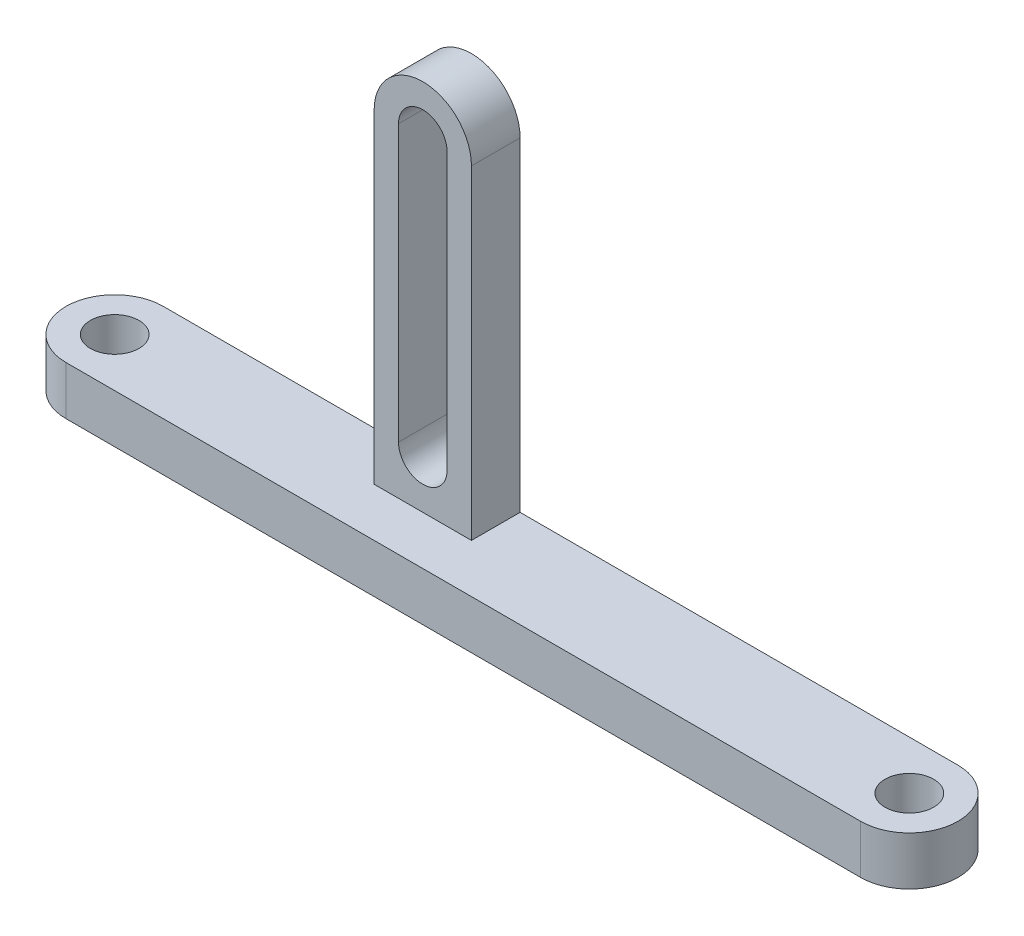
from build123d import *

# Parameters (mm, degrees)
BOSS_EXTRUDE1_DEPTH = 3
SKETCH2_R           = 1.5
BOSS_EXTRUDE2_DEPTH = 3


with BuildPart() as part:
    # Sketch1 → Boss-Extrude1 (new body)
    # profile 1 of 3: a face of its own
    with BuildSketch(Plane.XY):
        with BuildLine():
            Line((-3, 17), (-3, 0))
            ThreePointArc((-3, 0), (0, -3), (3, 0))
            Line((3, 0), (3, 17))
            ThreePointArc((3, 17), (0, 20), (-3, 17))
        make_face()
        with BuildLine():
            ThreePointArc((1.5, 17), (0, 18.5), (-1.5, 17))
            Line((-1.5, 17), (-1.5, 0))
            ThreePointArc((-1.5, 0), (0, -1.5), (1.5, 0))
            Line((1.5, 0), (1.5, 17))
        make_face(mode=Mode.SUBTRACT)
    # profile 2 of 3: a face of its own
    with BuildSketch(Plane.XY):
        with BuildLine():
            Line((3, -3), (3, 0))
            ThreePointArc((3, 0), (2.121320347, -2.12132034), (9e-09, -3))
            Line((9e-09, -3), (3, -3))
        make_face()
    # profile 3 of 3: a face of its own
    with BuildSketch(Plane.XY):
        with BuildLine():
            Line((-3, -3), (9e-09, -3))
            ThreePointArc((9e-09, -3), (-2.12132034, -2.121320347), (-3, 0))
            Line((-3, 0), (-3, -3))
        make_face()
    extrude(amount=BOSS_EXTRUDE1_DEPTH)

    # Sketch2 → Boss-Extrude2 (add)
    with BuildSketch(Plane.XZ.offset(3)):
        with BuildLine():
            Line((-19, 6), (30, 6))
            ThreePointArc((30, 6), (33, 3), (30, 0))
            Line((30, 0), (-19, 0))
            ThreePointArc((-19, 0), (-22, 3), (-19, 6))
        make_face()
        with Locations((-19, 3)):
            Circle(SKETCH2_R, mode=Mode.SUBTRACT)
        with Locations((30, 3)):
            Circle(SKETCH2_R, mode=Mode.SUBTRACT)
    extrude(amount=BOSS_EXTRUDE2_DEPTH)


solid = part.part
